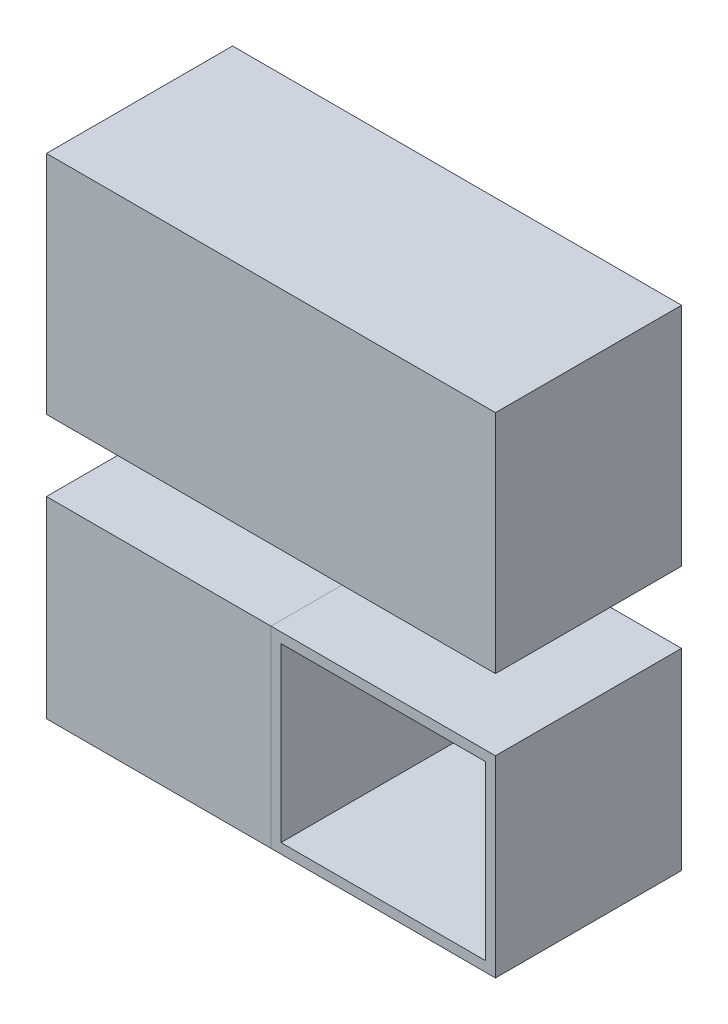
from build123d import *

# Parameters (mm, degrees)
SKETCH1_W      = 113.400591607
SKETCH1_H      = 57.081687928
EXTRUDE1_DEPTH = 46.99
SKETCH2_W      = 56.700295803
SKETCH2_H      = 48.610182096
EXTRUDE2_DEPTH = 46.99
SKETCH3_W      = 56.700295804
SKETCH3_H      = 48.610182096
EXTRUDE3_DEPTH = 46.99
SHELL1_T       = -2.54


with BuildPart() as part:
    # Sketch1 → Extrude1 (new body)
    with BuildSketch(Plane.XY):
        with Locations((56.700295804, 28.540843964)):
            Rectangle(SKETCH1_W, SKETCH1_H)
    extrude(amount=-EXTRUDE1_DEPTH)


with BuildPart() as body_2:
    # Sketch2 → Extrude2 (new body)
    with BuildSketch(Plane.XY):
        with Locations((28.350147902, -42.267987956)):
            Rectangle(SKETCH2_W, SKETCH2_H)
    extrude(amount=-EXTRUDE2_DEPTH)


with BuildPart() as body_3:
    # Sketch3 → Extrude3 (new body)
    with BuildSketch(Plane.XY):
        with Locations((85.050443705, -42.267987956)):
            Rectangle(SKETCH3_W, SKETCH3_H)
    extrude(amount=-EXTRUDE3_DEPTH)

    # Shell1
    shell1_openings = [body_3.faces().sort_by_distance(p)[0] for p in [
        (85.050443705, -42.267987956, 0),
    ]]
    offset(amount=SHELL1_T, openings=shell1_openings, kind=Kind.INTERSECTION)


solid = Compound([part.part, body_2.part, body_3.part])
